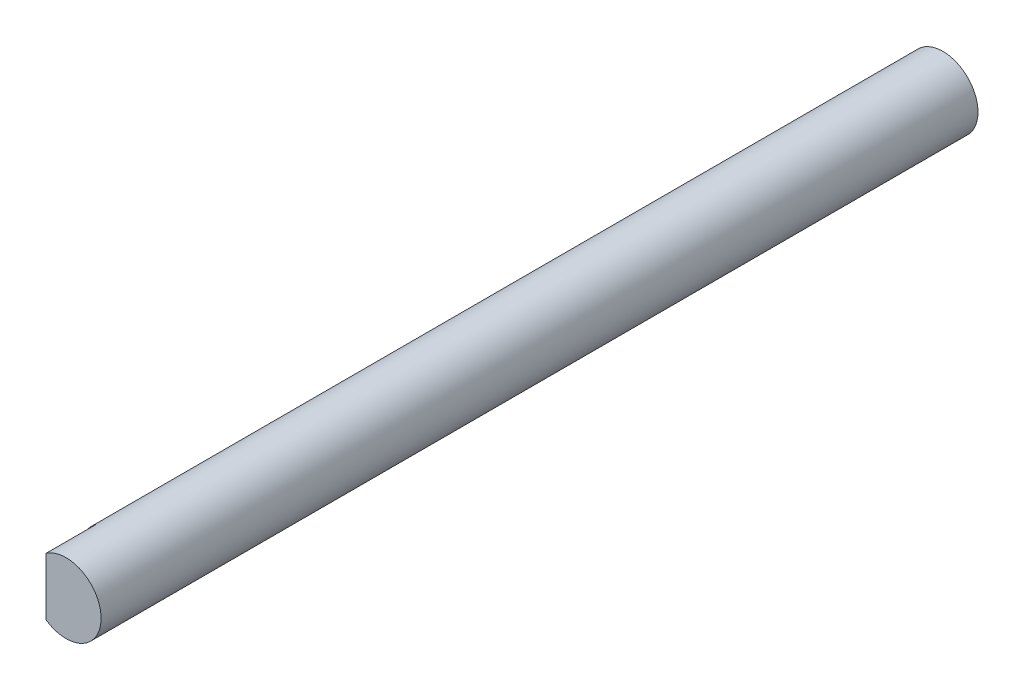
ISO-10303-21;
HEADER;
FILE_DESCRIPTION(('STEP AP214'),'2;1');
FILE_NAME('part.step','',(''),(''),'','','');
FILE_SCHEMA(('AUTOMOTIVE_DESIGN { 1 0 10303 214 1 1 1 1 }'));
ENDSEC;
DATA;
#1=APPLICATION_CONTEXT('core data for automotive mechanical design processes');
#2=APPLICATION_PROTOCOL_DEFINITION('international standard','automotive_design',2000,#1);
#3=PRODUCT_CONTEXT('',#1,'mechanical');
#4=PRODUCT('Part','Part','',(#3));
#5=PRODUCT_RELATED_PRODUCT_CATEGORY('part','',(#4));
#6=PRODUCT_DEFINITION_FORMATION('','',#4);
#7=PRODUCT_DEFINITION_CONTEXT('part definition',#1,'design');
#8=PRODUCT_DEFINITION('design','',#6,#7);
#9=PRODUCT_DEFINITION_SHAPE('','',#8);
#10=(LENGTH_UNIT() NAMED_UNIT(*) SI_UNIT(.MILLI.,.METRE.));
#11=(NAMED_UNIT(*) PLANE_ANGLE_UNIT() SI_UNIT($,.RADIAN.));
#12=(NAMED_UNIT(*) SI_UNIT($,.STERADIAN.) SOLID_ANGLE_UNIT());
#13=UNCERTAINTY_MEASURE_WITH_UNIT(LENGTH_MEASURE(1.E-05),#10,'distance_accuracy_value','');
#14=(GEOMETRIC_REPRESENTATION_CONTEXT(3) GLOBAL_UNCERTAINTY_ASSIGNED_CONTEXT((#13)) GLOBAL_UNIT_ASSIGNED_CONTEXT((#10,
#11,#12)) REPRESENTATION_CONTEXT('',''));
#15=CARTESIAN_POINT('',(0.,0.,0.));
#16=DIRECTION('',(0.,0.,1.));
#17=DIRECTION('',(1.,0.,0.));
#18=AXIS2_PLACEMENT_3D('',#15,#16,#17);
#19=CARTESIAN_POINT('',(0.,0.,175.));
#20=DIRECTION('',(0.,0.,-1.));
#21=DIRECTION('',(-1.,0.,0.));
#22=AXIS2_PLACEMENT_3D('',#19,#20,#21);
#23=CYLINDRICAL_SURFACE('',#22,7.);
#24=CARTESIAN_POINT('',(0.,0.,175.));
#25=DIRECTION('',(0.,0.,1.));
#26=DIRECTION('',(1.,0.,0.));
#27=AXIS2_PLACEMENT_3D('',#24,#25,#26);
#28=CIRCLE('',#27,7.);
#29=CARTESIAN_POINT('',(-4.,-5.74456264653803,175.));
#30=VERTEX_POINT('',#29);
#31=CARTESIAN_POINT('',(-4.,5.74456264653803,175.));
#32=VERTEX_POINT('',#31);
#33=EDGE_CURVE('E61',#30,#32,#28,.T.);
#34=ORIENTED_EDGE('',*,*,#33,.F.);
#35=DIRECTION('',(0.,0.,-1.));
#36=VECTOR('',#35,1.);
#37=CARTESIAN_POINT('',(-4.,-5.74456264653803,175.));
#38=LINE('',#37,#36);
#39=CARTESIAN_POINT('',(-4.,-5.74456264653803,165.));
#40=VERTEX_POINT('',#39);
#41=EDGE_CURVE('E45',#30,#40,#38,.T.);
#42=ORIENTED_EDGE('',*,*,#41,.T.);
#43=CARTESIAN_POINT('',(0.,0.,165.));
#44=DIRECTION('',(0.,0.,1.));
#45=DIRECTION('',(1.,0.,0.));
#46=AXIS2_PLACEMENT_3D('',#43,#44,#45);
#47=CIRCLE('',#46,7.);
#48=CARTESIAN_POINT('',(-4.,5.74456264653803,165.));
#49=VERTEX_POINT('',#48);
#50=EDGE_CURVE('E11',#49,#40,#47,.T.);
#51=ORIENTED_EDGE('',*,*,#50,.F.);
#52=DIRECTION('',(0.,0.,-1.));
#53=VECTOR('',#52,1.);
#54=CARTESIAN_POINT('',(-4.,5.74456264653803,175.));
#55=LINE('',#54,#53);
#56=EDGE_CURVE('E56',#49,#32,#55,.F.);
#57=ORIENTED_EDGE('',*,*,#56,.T.);
#58=EDGE_LOOP('',(#34,#42,#51,#57));
#59=FACE_BOUND('',#58,.T.);
#60=CARTESIAN_POINT('',(0.,0.,0.));
#61=DIRECTION('',(0.,0.,1.));
#62=DIRECTION('',(1.,0.,0.));
#63=AXIS2_PLACEMENT_3D('',#60,#61,#62);
#64=CIRCLE('',#63,7.);
#65=CARTESIAN_POINT('',(7.,0.,0.));
#66=VERTEX_POINT('',#65);
#67=EDGE_CURVE('E66',#66,#66,#64,.T.);
#68=ORIENTED_EDGE('',*,*,#67,.T.);
#69=EDGE_LOOP('',(#68));
#70=FACE_BOUND('',#69,.T.);
#71=ADVANCED_FACE('F31',(#59,#70),#23,.T.);
#72=CARTESIAN_POINT('',(0.,0.,175.));
#73=DIRECTION('',(0.,0.,1.));
#74=DIRECTION('',(1.,0.,0.));
#75=AXIS2_PLACEMENT_3D('',#72,#73,#74);
#76=PLANE('',#75);
#77=DIRECTION('',(0.,1.,0.));
#78=VECTOR('',#77,1.);
#79=CARTESIAN_POINT('',(-4.,0.,175.));
#80=LINE('',#79,#78);
#81=EDGE_CURVE('E38',#30,#32,#80,.T.);
#82=ORIENTED_EDGE('',*,*,#81,.F.);
#83=ORIENTED_EDGE('',*,*,#33,.T.);
#84=EDGE_LOOP('',(#82,#83));
#85=FACE_BOUND('',#84,.T.);
#86=ADVANCED_FACE('F65',(#85),#76,.T.);
#87=CARTESIAN_POINT('',(0.,0.,0.));
#88=DIRECTION('',(0.,0.,1.));
#89=DIRECTION('',(1.,0.,0.));
#90=AXIS2_PLACEMENT_3D('',#87,#88,#89);
#91=PLANE('',#90);
#92=ORIENTED_EDGE('',*,*,#67,.F.);
#93=EDGE_LOOP('',(#92));
#94=FACE_BOUND('',#93,.T.);
#95=ADVANCED_FACE('F75',(#94),#91,.F.);
#96=CARTESIAN_POINT('',(-4.,10.8140445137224,165.));
#97=DIRECTION('',(0.,0.,1.));
#98=DIRECTION('',(1.,0.,0.));
#99=AXIS2_PLACEMENT_3D('',#96,#97,#98);
#100=PLANE('',#99);
#101=DIRECTION('',(0.,1.,0.));
#102=VECTOR('',#101,1.);
#103=CARTESIAN_POINT('',(-4.,-17.2853329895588,165.));
#104=LINE('',#103,#102);
#105=EDGE_CURVE('E63',#40,#49,#104,.T.);
#106=ORIENTED_EDGE('',*,*,#105,.T.);
#107=ORIENTED_EDGE('',*,*,#50,.T.);
#108=EDGE_LOOP('',(#106,#107));
#109=FACE_BOUND('',#108,.T.);
#110=ADVANCED_FACE('F73',(#109),#100,.T.);
#111=CARTESIAN_POINT('',(-4.,-17.2853329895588,165.));
#112=DIRECTION('',(1.,0.,0.));
#113=DIRECTION('',(0.,0.,-1.));
#114=AXIS2_PLACEMENT_3D('',#111,#112,#113);
#115=PLANE('',#114);
#116=ORIENTED_EDGE('',*,*,#81,.T.);
#117=ORIENTED_EDGE('',*,*,#56,.F.);
#118=ORIENTED_EDGE('',*,*,#105,.F.);
#119=ORIENTED_EDGE('',*,*,#41,.F.);
#120=EDGE_LOOP('',(#116,#117,#118,#119));
#121=FACE_BOUND('',#120,.T.);
#122=ADVANCED_FACE('F55',(#121),#115,.F.);
#123=CLOSED_SHELL('',(#71,#86,#95,#110,#122));
#124=MANIFOLD_SOLID_BREP('B2',#123);
#125=ADVANCED_BREP_SHAPE_REPRESENTATION('',(#18,#124),#14);
#126=SHAPE_DEFINITION_REPRESENTATION(#9,#125);
ENDSEC;
END-ISO-10303-21;
